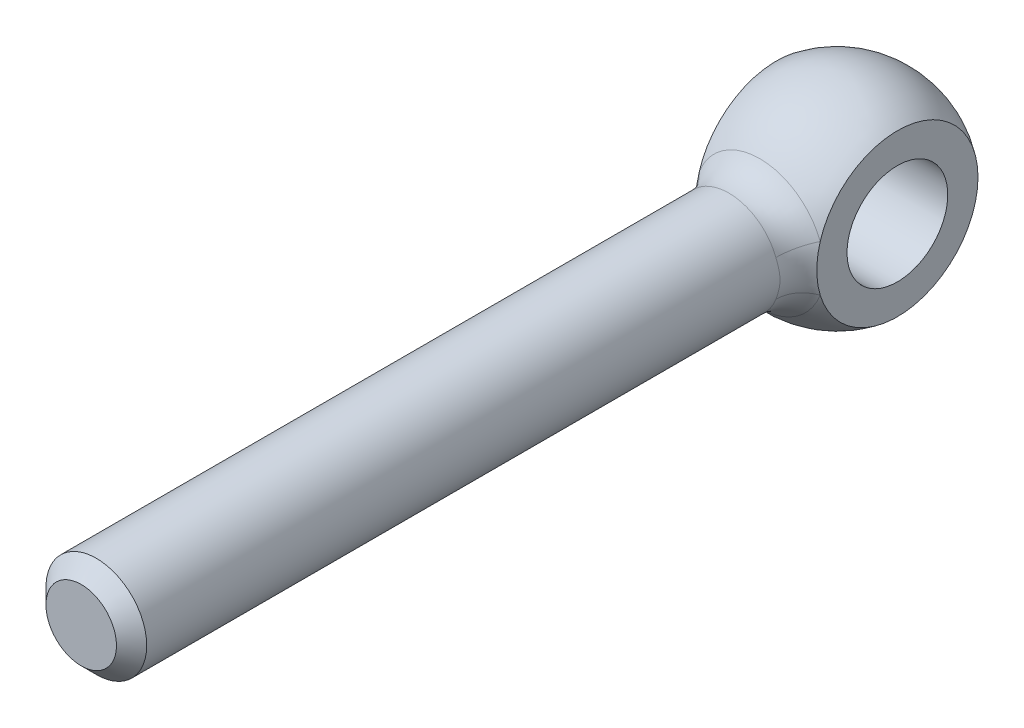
ISO-10303-21;
HEADER;
FILE_DESCRIPTION(('STEP AP214'),'2;1');
FILE_NAME('part.step','',(''),(''),'','','');
FILE_SCHEMA(('AUTOMOTIVE_DESIGN { 1 0 10303 214 1 1 1 1 }'));
ENDSEC;
DATA;
#1=APPLICATION_CONTEXT('core data for automotive mechanical design processes');
#2=APPLICATION_PROTOCOL_DEFINITION('international standard','automotive_design',2000,#1);
#3=PRODUCT_CONTEXT('',#1,'mechanical');
#4=PRODUCT('Part','Part','',(#3));
#5=PRODUCT_RELATED_PRODUCT_CATEGORY('part','',(#4));
#6=PRODUCT_DEFINITION_FORMATION('','',#4);
#7=PRODUCT_DEFINITION_CONTEXT('part definition',#1,'design');
#8=PRODUCT_DEFINITION('design','',#6,#7);
#9=PRODUCT_DEFINITION_SHAPE('','',#8);
#10=(LENGTH_UNIT() NAMED_UNIT(*) SI_UNIT(.MILLI.,.METRE.));
#11=(NAMED_UNIT(*) PLANE_ANGLE_UNIT() SI_UNIT($,.RADIAN.));
#12=(NAMED_UNIT(*) SI_UNIT($,.STERADIAN.) SOLID_ANGLE_UNIT());
#13=UNCERTAINTY_MEASURE_WITH_UNIT(LENGTH_MEASURE(1.E-05),#10,'distance_accuracy_value','');
#14=(GEOMETRIC_REPRESENTATION_CONTEXT(3) GLOBAL_UNCERTAINTY_ASSIGNED_CONTEXT((#13)) GLOBAL_UNIT_ASSIGNED_CONTEXT((#10,
#11,#12)) REPRESENTATION_CONTEXT('',''));
#15=CARTESIAN_POINT('',(0.,0.,0.));
#16=DIRECTION('',(0.,0.,1.));
#17=DIRECTION('',(1.,0.,0.));
#18=AXIS2_PLACEMENT_3D('',#15,#16,#17);
#19=CARTESIAN_POINT('',(0.,0.,0.));
#20=DIRECTION('',(-1.,0.,0.));
#21=DIRECTION('',(0.,0.,-1.));
#22=AXIS2_PLACEMENT_3D('',#19,#20,#21);
#23=SPHERICAL_SURFACE('',#22,10.);
#24=CARTESIAN_POINT('',(6.,0.,0.));
#25=DIRECTION('',(1.,0.,0.));
#26=DIRECTION('',(0.,0.,1.));
#27=AXIS2_PLACEMENT_3D('',#24,#25,#26);
#28=CIRCLE('',#27,8.);
#29=CARTESIAN_POINT('',(6.,2.30792777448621,7.65986092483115));
#30=VERTEX_POINT('',#29);
#31=CARTESIAN_POINT('',(6.,-2.30792777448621,7.65986092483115));
#32=VERTEX_POINT('',#31);
#33=EDGE_CURVE('E64',#30,#32,#28,.F.);
#34=ORIENTED_EDGE('',*,*,#33,.T.);
#35=CARTESIAN_POINT('',(0.,0.,7.65986092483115));
#36=DIRECTION('',(0.,0.,-1.));
#37=DIRECTION('',(-1.,0.,0.));
#38=AXIS2_PLACEMENT_3D('',#35,#36,#37);
#39=CIRCLE('',#38,6.42857142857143);
#40=CARTESIAN_POINT('',(-6.,-2.30792777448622,7.65986092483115));
#41=VERTEX_POINT('',#40);
#42=EDGE_CURVE('E72',#32,#41,#39,.T.);
#43=ORIENTED_EDGE('',*,*,#42,.T.);
#44=CARTESIAN_POINT('',(-6.,0.,0.));
#45=DIRECTION('',(1.,0.,0.));
#46=DIRECTION('',(0.,0.,1.));
#47=AXIS2_PLACEMENT_3D('',#44,#45,#46);
#48=CIRCLE('',#47,8.);
#49=CARTESIAN_POINT('',(-6.,2.30792777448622,7.65986092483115));
#50=VERTEX_POINT('',#49);
#51=EDGE_CURVE('E60',#50,#41,#48,.F.);
#52=ORIENTED_EDGE('',*,*,#51,.F.);
#53=CARTESIAN_POINT('',(0.,0.,7.65986092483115));
#54=DIRECTION('',(0.,0.,-1.));
#55=DIRECTION('',(-1.,0.,0.));
#56=AXIS2_PLACEMENT_3D('',#53,#54,#55);
#57=CIRCLE('',#56,6.42857142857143);
#58=EDGE_CURVE('E69',#50,#30,#57,.T.);
#59=ORIENTED_EDGE('',*,*,#58,.T.);
#60=EDGE_LOOP('',(#34,#43,#52,#59));
#61=FACE_BOUND('',#60,.T.);
#62=ADVANCED_FACE('F14',(#61),#23,.T.);
#63=CARTESIAN_POINT('',(0.,0.,-10.));
#64=DIRECTION('',(0.,0.,-1.));
#65=DIRECTION('',(1.,0.,0.));
#66=AXIS2_PLACEMENT_3D('',#63,#64,#65);
#67=CYLINDRICAL_SURFACE('',#66,5.);
#68=CARTESIAN_POINT('',(6.,3.2267323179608,7.3203960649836));
#69=CARTESIAN_POINT('',(4.3927793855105,2.40032191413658,8.4981017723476));
#70=CARTESIAN_POINT('',(4.26719928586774,2.60595668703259,10.6417078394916));
#71=CARTESIAN_POINT('',(6.,3.15637994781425,7.35140196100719));
#72=CARTESIAN_POINT('',(4.41396770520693,2.35868794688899,8.53415924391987));
#73=CARTESIAN_POINT('',(4.30636952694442,2.54182050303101,10.6569167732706));
#74=CARTESIAN_POINT('',(6.,3.0845678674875,7.38184900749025));
#75=CARTESIAN_POINT('',(4.43598568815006,2.31489371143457,8.5688842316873));
#76=CARTESIAN_POINT('',(4.34415743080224,2.47668749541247,10.6696741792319));
#77=CARTESIAN_POINT('',(6.,2.93788308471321,7.44144632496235));
#78=CARTESIAN_POINT('',(4.48100668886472,2.22296783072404,8.63529633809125));
#79=CARTESIAN_POINT('',(4.41682149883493,2.34464512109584,10.6908098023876));
#80=CARTESIAN_POINT('',(6.,2.86301195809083,7.4705972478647));
#81=CARTESIAN_POINT('',(4.50400416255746,2.1748602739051,8.6669999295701));
#82=CARTESIAN_POINT('',(4.45169913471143,2.27773667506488,10.699190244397));
#83=CARTESIAN_POINT('',(6.,2.63359256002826,7.55584558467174));
#84=CARTESIAN_POINT('',(4.5734661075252,2.02411950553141,8.75712422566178));
#85=CARTESIAN_POINT('',(4.55175884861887,2.07466593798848,10.7185614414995));
#86=CARTESIAN_POINT('',(6.,2.47414356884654,7.60978095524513));
#87=CARTESIAN_POINT('',(4.62076994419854,1.91438028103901,8.8111571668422));
#88=CARTESIAN_POINT('',(4.61242106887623,1.9360709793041,10.7238012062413));
#89=CARTESIAN_POINT('',(6.,2.15560728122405,7.70575431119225));
#90=CARTESIAN_POINT('',(4.70836207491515,1.68665244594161,8.90207343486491));
#91=CARTESIAN_POINT('',(4.71637744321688,1.66582754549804,10.7238090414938));
#92=CARTESIAN_POINT('',(6.,1.99760407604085,7.74840995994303));
#93=CARTESIAN_POINT('',(4.7489352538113,1.57023745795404,8.94011459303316));
#94=CARTESIAN_POINT('',(4.76069958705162,1.53456694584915,10.7194159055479));
#95=CARTESIAN_POINT('',(6.,1.67034421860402,7.82548342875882));
#96=CARTESIAN_POINT('',(4.82366839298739,1.32353889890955,9.00539080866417));
#97=CARTESIAN_POINT('',(4.83830988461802,1.26882691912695,10.7060668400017));
#98=CARTESIAN_POINT('',(6.,1.50108215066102,7.85989724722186));
#99=CARTESIAN_POINT('',(4.85792118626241,1.19318069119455,9.03274138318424));
#100=CARTESIAN_POINT('',(4.87159268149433,1.13434596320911,10.6971087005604));
#101=CARTESIAN_POINT('',(6.,1.15262565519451,7.91850047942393));
#102=CARTESIAN_POINT('',(4.91671483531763,0.921194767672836,9.07731285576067));
#103=CARTESIAN_POINT('',(4.92691418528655,0.862968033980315,10.6789999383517));
#104=CARTESIAN_POINT('',(6.,0.97342214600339,7.94268036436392));
#105=CARTESIAN_POINT('',(4.94135412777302,0.779366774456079,9.09462093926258));
#106=CARTESIAN_POINT('',(4.94894241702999,0.726068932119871,10.6698491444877));
#107=CARTESIAN_POINT('',(6.,0.608286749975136,7.97894634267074));
#108=CARTESIAN_POINT('',(4.97835060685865,0.488614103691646,9.11990305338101));
#109=CARTESIAN_POINT('',(4.98155564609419,0.450879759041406,10.6552429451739));
#110=CARTESIAN_POINT('',(6.,0.42235660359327,7.9910355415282));
#111=CARTESIAN_POINT('',(4.99079415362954,0.339389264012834,9.12793953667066));
#112=CARTESIAN_POINT('',(4.99214358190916,0.312590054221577,10.6497865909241));
#113=CARTESIAN_POINT('',(6.,0.0470401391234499,8.0020775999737));
#114=CARTESIAN_POINT('',(5.00212876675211,0.037959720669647,9.13527953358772));
#115=CARTESIAN_POINT('',(5.0018265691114,0.0346295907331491,10.6448278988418));
#116=CARTESIAN_POINT('',(6.,-0.142361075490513,8.0009406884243));
#117=CARTESIAN_POINT('',(5.00095572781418,-0.114635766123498,9.13454178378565));
#118=CARTESIAN_POINT('',(5.00084307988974,-0.105044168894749,10.6453662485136));
#119=CARTESIAN_POINT('',(6.,-0.51810128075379,7.98542192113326));
#120=CARTESIAN_POINT('',(4.98503390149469,-0.416175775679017,9.12417872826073));
#121=CARTESIAN_POINT('',(4.98720206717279,-0.383785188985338,10.652268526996));
#122=CARTESIAN_POINT('',(6.,-0.704439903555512,7.97103848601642));
#123=CARTESIAN_POINT('',(4.9702437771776,-0.565490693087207,9.11452643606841));
#124=CARTESIAN_POINT('',(4.97454315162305,-0.522852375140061,10.6586331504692));
#125=CARTESIAN_POINT('',(6.,-1.06953275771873,7.93031431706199));
#126=CARTESIAN_POINT('',(4.92878330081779,-0.855453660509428,9.08576459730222));
#127=CARTESIAN_POINT('',(4.93766171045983,-0.799340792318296,10.6744961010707));
#128=CARTESIAN_POINT('',(6.,-1.24828908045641,7.9039769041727));
#129=CARTESIAN_POINT('',(4.90202436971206,-0.996394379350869,9.06658927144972));
#130=CARTESIAN_POINT('',(4.91344239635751,-0.936762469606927,10.6839935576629));
#131=CARTESIAN_POINT('',(6.,-1.59553264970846,7.84126612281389));
#132=CARTESIAN_POINT('',(4.83940307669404,-1.26604567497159,9.01799514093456));
#133=CARTESIAN_POINT('',(4.85359923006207,-1.20914010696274,10.7020036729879));
#134=CARTESIAN_POINT('',(6.,-1.76401866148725,7.80489155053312));
#135=CARTESIAN_POINT('',(4.80342965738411,-1.39492473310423,8.98847100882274));
#136=CARTESIAN_POINT('',(4.81797400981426,-1.34409576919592,10.7105162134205));
#137=CARTESIAN_POINT('',(6.,-2.08964080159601,7.72409131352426));
#138=CARTESIAN_POINT('',(4.72580117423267,-1.63827852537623,8.91856014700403));
#139=CARTESIAN_POINT('',(4.7355062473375,-1.61073332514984,10.7220684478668));
#140=CARTESIAN_POINT('',(6.,-2.24676902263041,7.67966011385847));
#141=CARTESIAN_POINT('',(4.68404997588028,-1.75278971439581,8.87803959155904));
#142=CARTESIAN_POINT('',(4.68865598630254,-1.74241289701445,10.7251043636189));
#143=CARTESIAN_POINT('',(6.,-2.54938213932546,7.5845769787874));
#144=CARTESIAN_POINT('',(4.59869902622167,-1.96626185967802,8.78604728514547));
#145=CARTESIAN_POINT('',(4.58413287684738,-2.001300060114,10.7214381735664));
#146=CARTESIAN_POINT('',(6.,-2.69487333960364,7.53392844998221));
#147=CARTESIAN_POINT('',(4.55505237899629,-2.06517695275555,8.73445253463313));
#148=CARTESIAN_POINT('',(4.52646594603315,-2.1285100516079,10.7147413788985));
#149=CARTESIAN_POINT('',(6.,-2.97563340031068,7.42753384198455));
#150=CARTESIAN_POINT('',(4.46945882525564,-2.24823791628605,8.62043143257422));
#151=CARTESIAN_POINT('',(4.40053898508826,-2.37799449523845,10.6877579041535));
#152=CARTESIAN_POINT('',(6.,-3.11084689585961,7.37176329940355));
#153=CARTESIAN_POINT('',(4.42753255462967,-2.33217907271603,8.55784369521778));
#154=CARTESIAN_POINT('',(4.3322269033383,-2.50024076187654,10.6674027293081));
#155=CARTESIAN_POINT('',(6.,-3.30618612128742,7.28520546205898));
#156=CARTESIAN_POINT('',(4.36877466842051,-2.44740194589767,8.4568984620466));
#157=CARTESIAN_POINT('',(4.22266455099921,-2.6784309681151,10.6241540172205));
#158=CARTESIAN_POINT('',(6.,-3.37012775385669,7.25583055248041));
#159=CARTESIAN_POINT('',(4.34979966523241,-2.48417205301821,8.42189416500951));
#160=CARTESIAN_POINT('',(4.18490963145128,-2.73703466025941,10.6075896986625));
#161=CARTESIAN_POINT('',(6.,-3.49564302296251,7.19620015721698));
#162=CARTESIAN_POINT('',(4.31353045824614,-2.55449740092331,8.34959125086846));
#163=CARTESIAN_POINT('',(4.10720301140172,-2.85231842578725,10.5698584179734));
#164=CARTESIAN_POINT('',(6.,-3.55721601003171,7.16594443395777));
#165=CARTESIAN_POINT('',(4.29624676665,-2.58803247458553,8.31228600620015));
#166=CARTESIAN_POINT('',(4.06725071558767,-2.90899797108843,10.5486902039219));
#167=CARTESIAN_POINT('',(6.,-3.61768386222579,7.13529000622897));
#168=CARTESIAN_POINT('',(4.28001098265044,-2.62004266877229,8.27400289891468));
#169=CARTESIAN_POINT('',(4.02628463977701,-2.96463016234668,10.5250470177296));
#170=(BOUNDED_SURFACE() B_SPLINE_SURFACE(3,2,((#68,#69,#70),(#71,#72,#73),(#74,#75,#76),(#77,
#78,#79),(#80,#81,#82),(#83,#84,#85),(#86,#87,#88),(#89,#90,#91),(#92,#93,#94),(#95,#96,#97),
(#98,#99,#100),(#101,#102,#103),(#104,#105,#106),(#107,#108,#109),(#110,#111,#112),(#113,#114,
#115),(#116,#117,#118),(#119,#120,#121),(#122,#123,#124),(#125,#126,#127),(#128,#129,#130),
(#131,#132,#133),(#134,#135,#136),(#137,#138,#139),(#140,#141,#142),(#143,#144,#145),(#146,#147,
#148),(#149,#150,#151),(#152,#153,#154),(#155,#156,#157),(#158,#159,#160),(#161,#162,#163),
(#164,#165,#166),(#167,#168,#169)),.UNSPECIFIED.,.F.,.F.,.F.) B_SPLINE_SURFACE_WITH_KNOTS((4,2,
2,2,2,2,2,2,2,2,2,2,2,2,2,2,4),(3,3),(0.,0.408247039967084,0.816286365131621,1.63181270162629,
2.37916270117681,3.12687482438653,3.87528161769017,4.62349613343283,5.37679204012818,
6.13017777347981,6.88335433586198,7.63662127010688,8.39040767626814,9.14378289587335,
9.90096470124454,10.2805077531,10.6601541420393),(0.,1.),
.UNSPECIFIED.) GEOMETRIC_REPRESENTATION_ITEM() RATIONAL_B_SPLINE_SURFACE(((1.,0.880171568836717,
1.),(1.,0.8823764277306,1.),(1.,0.884598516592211,1.),(1.,0.889041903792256,1.),(1.,
0.891263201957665,1.),(1.,0.897873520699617,1.),(1.,0.902212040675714,1.),(1.,0.910097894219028,
1.),(1.,0.913681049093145,1.),(1.,0.920229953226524,1.),(1.,0.923195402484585,1.),(1.,
0.928274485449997,1.),(1.,0.93038732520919,1.),(1.,0.933563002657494,1.),(1.,0.934626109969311,
1.),(1.,0.935596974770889,1.),(1.,0.935496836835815,1.),(1.,0.934132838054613,1.),(1.,
0.932868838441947,1.),(1.,0.929307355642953,1.),(1.,0.927010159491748,1.),(1.,0.921590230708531,
1.),(1.,0.918467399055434,1.),(1.,0.911637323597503,1.),(1.,0.907929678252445,1.),(1.,
0.90018481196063,1.),(1.,0.89614777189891,1.),(1.,0.88796108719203,1.),(1.,0.883810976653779,
1.),(1.,0.877676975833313,1.),(1.,0.875645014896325,1.),(1.,0.871634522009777,1.),(1.,
0.8696560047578,1.),(1.,0.867715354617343,1.))) REPRESENTATION_ITEM('') SURFACE());
#171=CARTESIAN_POINT('',(4.02628463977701,-2.96463016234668,10.5250470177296));
#172=CARTESIAN_POINT('',(4.06725071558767,-2.90899797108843,10.5486902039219));
#173=CARTESIAN_POINT('',(4.10720301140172,-2.85231842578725,10.5698584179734));
#174=CARTESIAN_POINT('',(4.18490963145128,-2.73703466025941,10.6075896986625));
#175=CARTESIAN_POINT('',(4.22266455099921,-2.6784309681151,10.6241540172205));
#176=CARTESIAN_POINT('',(4.3322269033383,-2.50024076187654,10.6674027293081));
#177=CARTESIAN_POINT('',(4.40053898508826,-2.37799449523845,10.6877579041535));
#178=CARTESIAN_POINT('',(4.52646594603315,-2.1285100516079,10.7147413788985));
#179=CARTESIAN_POINT('',(4.58413287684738,-2.001300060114,10.7214381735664));
#180=CARTESIAN_POINT('',(4.68865598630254,-1.74241289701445,10.7251043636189));
#181=CARTESIAN_POINT('',(4.7355062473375,-1.61073332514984,10.7220684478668));
#182=CARTESIAN_POINT('',(4.81797400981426,-1.34409576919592,10.7105162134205));
#183=CARTESIAN_POINT('',(4.85359923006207,-1.20914010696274,10.7020036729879));
#184=CARTESIAN_POINT('',(4.91344239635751,-0.936762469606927,10.6839935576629));
#185=CARTESIAN_POINT('',(4.93766171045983,-0.799340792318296,10.6744961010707));
#186=CARTESIAN_POINT('',(4.97454315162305,-0.522852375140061,10.6586331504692));
#187=CARTESIAN_POINT('',(4.98720206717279,-0.383785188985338,10.652268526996));
#188=CARTESIAN_POINT('',(5.00084307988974,-0.105044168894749,10.6453662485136));
#189=CARTESIAN_POINT('',(5.0018265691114,0.0346295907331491,10.6448278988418));
#190=CARTESIAN_POINT('',(4.99214358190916,0.312590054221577,10.6497865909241));
#191=CARTESIAN_POINT('',(4.98155564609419,0.450879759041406,10.6552429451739));
#192=CARTESIAN_POINT('',(4.94894241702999,0.726068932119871,10.6698491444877));
#193=CARTESIAN_POINT('',(4.92691418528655,0.862968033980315,10.6789999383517));
#194=CARTESIAN_POINT('',(4.87159268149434,1.13434596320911,10.6971087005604));
#195=CARTESIAN_POINT('',(4.83830988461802,1.26882691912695,10.7060668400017));
#196=CARTESIAN_POINT('',(4.76069958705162,1.53456694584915,10.7194159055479));
#197=CARTESIAN_POINT('',(4.71637744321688,1.66582754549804,10.7238090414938));
#198=CARTESIAN_POINT('',(4.61242106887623,1.9360709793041,10.7238012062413));
#199=CARTESIAN_POINT('',(4.55175884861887,2.07466593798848,10.7185614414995));
#200=CARTESIAN_POINT('',(4.45169913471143,2.27773667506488,10.699190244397));
#201=CARTESIAN_POINT('',(4.41682149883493,2.34464512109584,10.6908098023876));
#202=CARTESIAN_POINT('',(4.34415743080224,2.47668749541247,10.6696741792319));
#203=CARTESIAN_POINT('',(4.30636952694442,2.54182050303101,10.6569167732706));
#204=CARTESIAN_POINT('',(4.26719928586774,2.60595668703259,10.6417078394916));
#205=B_SPLINE_CURVE_WITH_KNOTS('',3,(#171,#172,#173,#174,#175,#176,#177,#178,#179,#180,#181,
#182,#183,#184,#185,#186,#187,#188,#189,#190,#191,#192,#193,#194,#195,#196,#197,#198,#199,#200,
#201,#202,#203,#204),.UNSPECIFIED.,.F.,.F.,(4,2,2,2,2,2,2,2,2,2,2,2,2,2,2,2,4),(0.,
0.379646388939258,0.759189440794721,1.51637124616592,2.26974646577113,3.02353287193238,
3.77679980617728,4.52997636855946,5.28336210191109,6.03665800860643,6.7848725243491,
7.53327931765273,8.28099144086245,9.02834144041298,9.84386777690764,10.2519071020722,
10.6601541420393),.UNSPECIFIED.);
#206=CARTESIAN_POINT('',(4.66666666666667,-1.7950549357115,10.7238052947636));
#207=VERTEX_POINT('',#206);
#208=CARTESIAN_POINT('',(4.66666666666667,1.7950549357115,10.7238052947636));
#209=VERTEX_POINT('',#208);
#210=EDGE_CURVE('E87',#207,#209,#205,.T.);
#211=ORIENTED_EDGE('',*,*,#210,.T.);
#212=CARTESIAN_POINT('',(0.,0.,10.7238052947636));
#213=DIRECTION('',(0.,0.,-1.));
#214=DIRECTION('',(-1.,0.,0.));
#215=AXIS2_PLACEMENT_3D('',#212,#213,#214);
#216=CIRCLE('',#215,5.);
#217=CARTESIAN_POINT('',(-4.66666666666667,1.79505493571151,10.7238052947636));
#218=VERTEX_POINT('',#217);
#219=EDGE_CURVE('E9',#209,#218,#216,.F.);
#220=ORIENTED_EDGE('',*,*,#219,.T.);
#221=CARTESIAN_POINT('',(-6.,-3.2267323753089,7.32039603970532));
#222=CARTESIAN_POINT('',(-4.39277936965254,-2.40032194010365,8.49810174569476));
#223=CARTESIAN_POINT('',(-4.26719928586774,-2.60595668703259,10.6417078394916));
#224=CARTESIAN_POINT('',(-6.,-3.15637996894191,7.35140195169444));
#225=CARTESIAN_POINT('',(-4.41396769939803,-2.35868795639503,8.53415923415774));
#226=CARTESIAN_POINT('',(-4.30636952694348,-2.54182050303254,10.6569167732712));
#227=CARTESIAN_POINT('',(-6.,-3.08456787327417,7.38184900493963));
#228=CARTESIAN_POINT('',(-4.43598568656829,-2.31489371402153,8.5688842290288));
#229=CARTESIAN_POINT('',(-4.34415743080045,-2.47668749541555,10.6696741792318));
#230=CARTESIAN_POINT('',(-6.,-2.93788307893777,7.4414463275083));
#231=CARTESIAN_POINT('',(-4.48100669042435,-2.22296782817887,8.63529634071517));
#232=CARTESIAN_POINT('',(-4.41682149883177,-2.34464512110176,10.6908098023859));
#233=CARTESIAN_POINT('',(-6.,-2.86301195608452,7.47059724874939));
#234=CARTESIAN_POINT('',(-4.50400416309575,-2.17486027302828,8.66699993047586));
#235=CARTESIAN_POINT('',(-4.45169913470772,-2.27773667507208,10.6991902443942));
#236=CARTESIAN_POINT('',(-6.,-2.63359256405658,7.55584558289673));
#237=CARTESIAN_POINT('',(-4.57346610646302,-2.02411950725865,8.75712422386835));
#238=CARTESIAN_POINT('',(-4.55175884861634,-2.07466593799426,10.7185614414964));
#239=CARTESIAN_POINT('',(-6.,-2.47414356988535,7.60978095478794));
#240=CARTESIAN_POINT('',(-4.62076994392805,-1.91438028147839,8.81115716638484));
#241=CARTESIAN_POINT('',(-4.6124210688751,-1.93607097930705,10.7238012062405));
#242=CARTESIAN_POINT('',(-6.,-2.15560728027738,7.70575431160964));
#243=CARTESIAN_POINT('',(-4.70836207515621,-1.68665244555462,8.9020734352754));
#244=CARTESIAN_POINT('',(-4.71637744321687,-1.66582754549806,10.7238090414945));
#245=CARTESIAN_POINT('',(-6.,-1.99760407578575,7.74840996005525));
#246=CARTESIAN_POINT('',(-4.74893525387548,-1.57023745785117,8.94011459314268));
#247=CARTESIAN_POINT('',(-4.76069958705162,-1.53456694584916,10.7194159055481));
#248=CARTESIAN_POINT('',(-6.,-1.67034421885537,7.82548342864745));
#249=CARTESIAN_POINT('',(-4.82366839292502,-1.3235388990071,9.00539080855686));
#250=CARTESIAN_POINT('',(-4.83830988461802,-1.26882691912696,10.7060668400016));
#251=CARTESIAN_POINT('',(-6.,-1.50108215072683,7.85989724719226));
#252=CARTESIAN_POINT('',(-4.85792118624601,-1.19318069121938,9.03274138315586));
#253=CARTESIAN_POINT('',(-4.87159268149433,-1.13434596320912,10.6971087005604));
#254=CARTESIAN_POINT('',(-6.,-1.15262565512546,7.91850047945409));
#255=CARTESIAN_POINT('',(-4.91671483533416,-0.921194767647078,9.07731285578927));
#256=CARTESIAN_POINT('',(-4.92691418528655,-0.862968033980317,10.6789999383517));
#257=CARTESIAN_POINT('',(-6.,-0.973422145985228,7.942680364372));
#258=CARTESIAN_POINT('',(-4.94135412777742,-0.779366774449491,9.09462093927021));
#259=CARTESIAN_POINT('',(-4.94894241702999,-0.726068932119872,10.6698491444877));
#260=CARTESIAN_POINT('',(-6.,-0.608286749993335,7.97894634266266));
#261=CARTESIAN_POINT('',(-4.97835060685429,-0.488614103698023,9.11990305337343));
#262=CARTESIAN_POINT('',(-4.98155564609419,-0.450879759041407,10.6552429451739));
#263=CARTESIAN_POINT('',(-6.,-0.422356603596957,7.99103554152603));
#264=CARTESIAN_POINT('',(-4.99079415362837,-0.339389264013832,9.12793953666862));
#265=CARTESIAN_POINT('',(-4.99214358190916,-0.312590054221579,10.6497865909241));
#266=CARTESIAN_POINT('',(-6.,-0.047040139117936,8.00207759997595));
#267=CARTESIAN_POINT('',(-5.00212876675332,-0.0379597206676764,9.13527953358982));
#268=CARTESIAN_POINT('',(-5.0018265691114,-0.0346295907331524,10.6448278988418));
#269=CARTESIAN_POINT('',(-6.,0.142361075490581,8.00094068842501));
#270=CARTESIAN_POINT('',(-5.00095572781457,0.11463576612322,9.1345417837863));
#271=CARTESIAN_POINT('',(-5.00084307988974,0.105044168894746,10.6453662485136));
#272=CARTESIAN_POINT('',(-6.,0.518101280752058,7.98542192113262));
#273=CARTESIAN_POINT('',(-4.98503390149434,0.41617577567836,9.12417872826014));
#274=CARTESIAN_POINT('',(-4.9872020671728,0.383785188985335,10.652268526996));
#275=CARTESIAN_POINT('',(-6.,0.704439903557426,7.97103848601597));
#276=CARTESIAN_POINT('',(-4.97024377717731,0.565490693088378,9.11452643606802));
#277=CARTESIAN_POINT('',(-4.97454315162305,0.522852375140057,10.6586331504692));
#278=CARTESIAN_POINT('',(-6.,1.06953275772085,7.93031431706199));
#279=CARTESIAN_POINT('',(-4.92878330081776,0.85545366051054,9.08576459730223));
#280=CARTESIAN_POINT('',(-4.93766171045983,0.799340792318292,10.6744961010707));
#281=CARTESIAN_POINT('',(-6.,1.2482890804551,7.90397690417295));
#282=CARTESIAN_POINT('',(-4.90202436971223,0.996394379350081,9.06658927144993));
#283=CARTESIAN_POINT('',(-4.91344239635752,0.936762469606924,10.6839935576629));
#284=CARTESIAN_POINT('',(-6.,1.59553264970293,7.84126612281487));
#285=CARTESIAN_POINT('',(-4.83940307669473,1.26604567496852,9.01799514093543));
#286=CARTESIAN_POINT('',(-4.85359923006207,1.20914010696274,10.7020036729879));
#287=CARTESIAN_POINT('',(-6.,1.76401866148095,7.80489155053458));
#288=CARTESIAN_POINT('',(-4.80342965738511,1.39492473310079,8.98847100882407));
#289=CARTESIAN_POINT('',(-4.81797400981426,1.34409576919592,10.7105162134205));
#290=CARTESIAN_POINT('',(-6.,2.08964080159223,7.72409131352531));
#291=CARTESIAN_POINT('',(-4.72580117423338,1.63827852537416,8.918560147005));
#292=CARTESIAN_POINT('',(-4.7355062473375,1.61073332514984,10.7220684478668));
#293=CARTESIAN_POINT('',(-6.,2.24676902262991,7.67966011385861));
#294=CARTESIAN_POINT('',(-4.68404997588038,1.75278971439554,8.87803959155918));
#295=CARTESIAN_POINT('',(-4.68865598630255,1.74241289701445,10.7251043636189));
#296=CARTESIAN_POINT('',(-6.,2.54938213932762,7.58457697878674));
#297=CARTESIAN_POINT('',(-4.59869902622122,1.96626185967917,8.78604728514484));
#298=CARTESIAN_POINT('',(-4.58413287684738,2.00130006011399,10.7214381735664));
#299=CARTESIAN_POINT('',(-6.,2.69487333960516,7.53392844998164));
#300=CARTESIAN_POINT('',(-4.55505237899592,2.06517695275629,8.73445253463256));
#301=CARTESIAN_POINT('',(-4.52646594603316,2.12851005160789,10.7147413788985));
#302=CARTESIAN_POINT('',(-6.,2.97563340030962,7.42753384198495));
#303=CARTESIAN_POINT('',(-4.4694588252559,2.24823791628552,8.62043143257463));
#304=CARTESIAN_POINT('',(-4.40053898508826,2.37799449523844,10.6877579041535));
#305=CARTESIAN_POINT('',(-6.,3.11084689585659,7.37176329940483));
#306=CARTESIAN_POINT('',(-4.42753255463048,2.33217907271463,8.55784369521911));
#307=CARTESIAN_POINT('',(-4.33222690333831,2.50024076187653,10.6674027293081));
#308=CARTESIAN_POINT('',(-6.,3.30618612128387,7.28520546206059));
#309=CARTESIAN_POINT('',(-4.3687746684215,2.44740194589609,8.45689846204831));
#310=CARTESIAN_POINT('',(-4.22266455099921,2.67843096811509,10.6241540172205));
#311=CARTESIAN_POINT('',(-6.,3.37012775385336,7.25583055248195));
#312=CARTESIAN_POINT('',(-4.34979966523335,2.48417205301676,8.42189416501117));
#313=CARTESIAN_POINT('',(-4.18490963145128,2.73703466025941,10.6075896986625));
#314=CARTESIAN_POINT('',(-6.,3.4956430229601,7.19620015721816));
#315=CARTESIAN_POINT('',(-4.31353045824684,2.55449740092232,8.34959125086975));
#316=CARTESIAN_POINT('',(-4.10720301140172,2.85231842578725,10.5698584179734));
#317=CARTESIAN_POINT('',(-6.,3.55721601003,7.16594443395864));
#318=CARTESIAN_POINT('',(-4.2962467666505,2.58803247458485,8.3122860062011));
#319=CARTESIAN_POINT('',(-4.06725071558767,2.90899797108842,10.5486902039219));
#320=CARTESIAN_POINT('',(-6.,3.61768386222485,7.13529000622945));
#321=CARTESIAN_POINT('',(-4.28001098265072,2.62004266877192,8.27400289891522));
#322=CARTESIAN_POINT('',(-4.02628463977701,2.96463016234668,10.5250470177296));
#323=(BOUNDED_SURFACE() B_SPLINE_SURFACE(3,2,((#221,#222,#223),(#224,#225,#226),(#227,#228,
#229),(#230,#231,#232),(#233,#234,#235),(#236,#237,#238),(#239,#240,#241),(#242,#243,#244),
(#245,#246,#247),(#248,#249,#250),(#251,#252,#253),(#254,#255,#256),(#257,#258,#259),(#260,#261,
#262),(#263,#264,#265),(#266,#267,#268),(#269,#270,#271),(#272,#273,#274),(#275,#276,#277),
(#278,#279,#280),(#281,#282,#283),(#284,#285,#286),(#287,#288,#289),(#290,#291,#292),(#293,#294,
#295),(#296,#297,#298),(#299,#300,#301),(#302,#303,#304),(#305,#306,#307),(#308,#309,#310),
(#311,#312,#313),(#314,#315,#316),(#317,#318,#319),(#320,#321,#322)),.UNSPECIFIED.,.F.,.F.,
.F.) B_SPLINE_SURFACE_WITH_KNOTS((4,2,2,2,2,2,2,2,2,2,2,2,2,2,2,2,4),(3,3),(0.,
0.408247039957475,0.816286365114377,1.63181270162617,2.37916270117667,3.12687482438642,
3.87528161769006,4.62349613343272,5.37679204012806,6.13017777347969,6.88335433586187,
7.63662127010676,8.39040767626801,9.14378289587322,9.90096470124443,10.2805077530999,
10.6601541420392),(0.,1.),
.UNSPECIFIED.) GEOMETRIC_REPRESENTATION_ITEM() RATIONAL_B_SPLINE_SURFACE(((1.,0.880171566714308,
1.),(1.,0.882376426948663,1.),(1.,0.884598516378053,1.),(1.,0.88904190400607,1.),(1.,
0.89126320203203,1.),(1.,0.897873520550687,1.),(1.,0.902212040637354,1.),(1.,0.910097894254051,
1.),(1.,0.913681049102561,1.),(1.,0.920229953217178,1.),(1.,0.9231954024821,1.),(1.,
0.928274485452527,1.),(1.,0.930387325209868,1.),(1.,0.933563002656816,1.),(1.,0.934626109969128,
1.),(1.,0.935596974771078,1.),(1.,0.935496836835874,1.),(1.,0.93413283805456,1.),(1.,
0.93286883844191,1.),(1.,0.929307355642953,1.),(1.,0.927010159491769,1.),(1.,0.921590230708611,
1.),(1.,0.918467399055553,1.),(1.,0.911637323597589,1.),(1.,0.907929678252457,1.),(1.,
0.900184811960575,1.),(1.,0.896147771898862,1.),(1.,0.887961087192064,1.),(1.,0.883810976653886,
1.),(1.,0.877676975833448,1.),(1.,0.875645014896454,1.),(1.,0.871634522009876,1.),(1.,
0.869656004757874,1.),(1.,0.867715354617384,1.))) REPRESENTATION_ITEM('') SURFACE());
#324=CARTESIAN_POINT('',(-4.02628463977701,2.96463016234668,10.5250470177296));
#325=CARTESIAN_POINT('',(-4.06725071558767,2.90899797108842,10.5486902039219));
#326=CARTESIAN_POINT('',(-4.10720301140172,2.85231842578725,10.5698584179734));
#327=CARTESIAN_POINT('',(-4.18490963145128,2.73703466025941,10.6075896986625));
#328=CARTESIAN_POINT('',(-4.22266455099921,2.67843096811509,10.6241540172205));
#329=CARTESIAN_POINT('',(-4.33222690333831,2.50024076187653,10.6674027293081));
#330=CARTESIAN_POINT('',(-4.40053898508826,2.37799449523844,10.6877579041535));
#331=CARTESIAN_POINT('',(-4.52646594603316,2.12851005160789,10.7147413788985));
#332=CARTESIAN_POINT('',(-4.58413287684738,2.00130006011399,10.7214381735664));
#333=CARTESIAN_POINT('',(-4.68865598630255,1.74241289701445,10.7251043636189));
#334=CARTESIAN_POINT('',(-4.7355062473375,1.61073332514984,10.7220684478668));
#335=CARTESIAN_POINT('',(-4.81797400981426,1.34409576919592,10.7105162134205));
#336=CARTESIAN_POINT('',(-4.85359923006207,1.20914010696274,10.7020036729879));
#337=CARTESIAN_POINT('',(-4.91344239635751,0.936762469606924,10.6839935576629));
#338=CARTESIAN_POINT('',(-4.93766171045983,0.799340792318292,10.6744961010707));
#339=CARTESIAN_POINT('',(-4.97454315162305,0.522852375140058,10.6586331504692));
#340=CARTESIAN_POINT('',(-4.9872020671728,0.383785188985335,10.652268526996));
#341=CARTESIAN_POINT('',(-5.00084307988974,0.105044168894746,10.6453662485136));
#342=CARTESIAN_POINT('',(-5.0018265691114,-0.0346295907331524,10.6448278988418));
#343=CARTESIAN_POINT('',(-4.99214358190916,-0.312590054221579,10.6497865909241));
#344=CARTESIAN_POINT('',(-4.98155564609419,-0.450879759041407,10.6552429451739));
#345=CARTESIAN_POINT('',(-4.94894241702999,-0.726068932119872,10.6698491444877));
#346=CARTESIAN_POINT('',(-4.92691418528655,-0.862968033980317,10.6789999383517));
#347=CARTESIAN_POINT('',(-4.87159268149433,-1.13434596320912,10.6971087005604));
#348=CARTESIAN_POINT('',(-4.83830988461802,-1.26882691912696,10.7060668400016));
#349=CARTESIAN_POINT('',(-4.76069958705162,-1.53456694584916,10.7194159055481));
#350=CARTESIAN_POINT('',(-4.71637744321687,-1.66582754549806,10.7238090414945));
#351=CARTESIAN_POINT('',(-4.6124210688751,-1.93607097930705,10.7238012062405));
#352=CARTESIAN_POINT('',(-4.55175884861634,-2.07466593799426,10.7185614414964));
#353=CARTESIAN_POINT('',(-4.45169913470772,-2.27773667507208,10.6991902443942));
#354=CARTESIAN_POINT('',(-4.41682149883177,-2.34464512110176,10.6908098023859));
#355=CARTESIAN_POINT('',(-4.34415743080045,-2.47668749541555,10.6696741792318));
#356=CARTESIAN_POINT('',(-4.30636952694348,-2.54182050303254,10.6569167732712));
#357=CARTESIAN_POINT('',(-4.26719928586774,-2.60595668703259,10.6417078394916));
#358=B_SPLINE_CURVE_WITH_KNOTS('',3,(#324,#325,#326,#327,#328,#329,#330,#331,#332,#333,#334,
#335,#336,#337,#338,#339,#340,#341,#342,#343,#344,#345,#346,#347,#348,#349,#350,#351,#352,#353,
#354,#355,#356,#357),.UNSPECIFIED.,.F.,.F.,(4,2,2,2,2,2,2,2,2,2,2,2,2,2,2,2,4),(0.,
0.379646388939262,0.759189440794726,1.51637124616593,2.26974646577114,3.02353287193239,
3.77679980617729,4.52997636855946,5.28336210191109,6.03665800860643,6.78487252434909,
7.53327931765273,8.28099144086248,9.02834144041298,9.84386777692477,10.2519071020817,
10.6601541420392),.UNSPECIFIED.);
#359=CARTESIAN_POINT('',(-4.66666666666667,-1.79505493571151,10.7238052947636));
#360=VERTEX_POINT('',#359);
#361=EDGE_CURVE('E27',#218,#360,#358,.T.);
#362=ORIENTED_EDGE('',*,*,#361,.T.);
#363=CARTESIAN_POINT('',(0.,0.,10.7238052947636));
#364=DIRECTION('',(0.,0.,-1.));
#365=DIRECTION('',(-1.,0.,0.));
#366=AXIS2_PLACEMENT_3D('',#363,#364,#365);
#367=CIRCLE('',#366,5.);
#368=EDGE_CURVE('E101',#360,#207,#367,.F.);
#369=ORIENTED_EDGE('',*,*,#368,.T.);
#370=EDGE_LOOP('',(#211,#220,#362,#369));
#371=FACE_BOUND('',#370,.T.);
#372=CARTESIAN_POINT('',(0.,0.,73.5));
#373=DIRECTION('',(0.,0.,-1.));
#374=DIRECTION('',(1.,0.,0.));
#375=AXIS2_PLACEMENT_3D('',#372,#373,#374);
#376=CIRCLE('',#375,5.);
#377=CARTESIAN_POINT('',(5.,0.,73.5));
#378=VERTEX_POINT('',#377);
#379=EDGE_CURVE('E85',#378,#378,#376,.T.);
#380=ORIENTED_EDGE('',*,*,#379,.T.);
#381=EDGE_LOOP('',(#380));
#382=FACE_BOUND('',#381,.T.);
#383=ADVANCED_FACE('F107',(#371,#382),#67,.T.);
#384=CARTESIAN_POINT('',(0.,0.,75.));
#385=DIRECTION('',(0.,0.,-1.));
#386=DIRECTION('',(1.,0.,0.));
#387=AXIS2_PLACEMENT_3D('',#384,#385,#386);
#388=CONICAL_SURFACE('',#387,3.5,0.785398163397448);
#389=ORIENTED_EDGE('',*,*,#379,.F.);
#390=EDGE_LOOP('',(#389));
#391=FACE_BOUND('',#390,.T.);
#392=CARTESIAN_POINT('',(0.,0.,75.));
#393=DIRECTION('',(0.,0.,-1.));
#394=DIRECTION('',(1.,0.,0.));
#395=AXIS2_PLACEMENT_3D('',#392,#393,#394);
#396=CIRCLE('',#395,3.5);
#397=CARTESIAN_POINT('',(3.5,0.,75.));
#398=VERTEX_POINT('',#397);
#399=EDGE_CURVE('E73',#398,#398,#396,.T.);
#400=ORIENTED_EDGE('',*,*,#399,.T.);
#401=EDGE_LOOP('',(#400));
#402=FACE_BOUND('',#401,.T.);
#403=ADVANCED_FACE('F111',(#391,#402),#388,.T.);
#404=CARTESIAN_POINT('',(0.,-3.5,75.));
#405=DIRECTION('',(0.,0.,1.));
#406=DIRECTION('',(-1.,0.,0.));
#407=AXIS2_PLACEMENT_3D('',#404,#405,#406);
#408=PLANE('',#407);
#409=ORIENTED_EDGE('',*,*,#399,.F.);
#410=EDGE_LOOP('',(#409));
#411=FACE_BOUND('',#410,.T.);
#412=ADVANCED_FACE('F158',(#411),#408,.T.);
#413=CARTESIAN_POINT('',(-6.,15.,-10.));
#414=DIRECTION('',(1.,0.,0.));
#415=DIRECTION('',(0.,0.,1.));
#416=AXIS2_PLACEMENT_3D('',#413,#414,#415);
#417=PLANE('',#416);
#418=CARTESIAN_POINT('',(-6.,0.,0.));
#419=DIRECTION('',(1.,0.,0.));
#420=DIRECTION('',(0.,0.,1.));
#421=AXIS2_PLACEMENT_3D('',#418,#419,#420);
#422=CIRCLE('',#421,5.);
#423=CARTESIAN_POINT('',(-6.,0.,5.));
#424=VERTEX_POINT('',#423);
#425=EDGE_CURVE('E253',#424,#424,#422,.T.);
#426=ORIENTED_EDGE('',*,*,#425,.T.);
#427=EDGE_LOOP('',(#426));
#428=FACE_BOUND('',#427,.T.);
#429=ORIENTED_EDGE('',*,*,#51,.T.);
#430=EDGE_CURVE('E57',#41,#50,#48,.F.);
#431=ORIENTED_EDGE('',*,*,#430,.T.);
#432=EDGE_LOOP('',(#429,#431));
#433=FACE_BOUND('',#432,.T.);
#434=ADVANCED_FACE('F59',(#428,#433),#417,.F.);
#435=CARTESIAN_POINT('',(6.,15.,-10.));
#436=DIRECTION('',(1.,0.,0.));
#437=DIRECTION('',(0.,0.,1.));
#438=AXIS2_PLACEMENT_3D('',#435,#436,#437);
#439=PLANE('',#438);
#440=CARTESIAN_POINT('',(6.,0.,0.));
#441=DIRECTION('',(1.,0.,0.));
#442=DIRECTION('',(0.,0.,1.));
#443=AXIS2_PLACEMENT_3D('',#440,#441,#442);
#444=CIRCLE('',#443,5.);
#445=CARTESIAN_POINT('',(6.,0.,5.));
#446=VERTEX_POINT('',#445);
#447=EDGE_CURVE('E78',#446,#446,#444,.T.);
#448=ORIENTED_EDGE('',*,*,#447,.F.);
#449=EDGE_LOOP('',(#448));
#450=FACE_BOUND('',#449,.T.);
#451=ORIENTED_EDGE('',*,*,#33,.F.);
#452=EDGE_CURVE('E249',#32,#30,#28,.F.);
#453=ORIENTED_EDGE('',*,*,#452,.F.);
#454=EDGE_LOOP('',(#451,#453));
#455=FACE_BOUND('',#454,.T.);
#456=ADVANCED_FACE('F151',(#450,#455),#439,.T.);
#457=CARTESIAN_POINT('',(10.,0.,0.));
#458=DIRECTION('',(-1.,0.,0.));
#459=DIRECTION('',(0.,0.,-1.));
#460=AXIS2_PLACEMENT_3D('',#457,#458,#459);
#461=CYLINDRICAL_SURFACE('',#460,5.);
#462=ORIENTED_EDGE('',*,*,#447,.T.);
#463=EDGE_LOOP('',(#462));
#464=FACE_BOUND('',#463,.T.);
#465=ORIENTED_EDGE('',*,*,#425,.F.);
#466=EDGE_LOOP('',(#465));
#467=FACE_BOUND('',#466,.T.);
#468=ADVANCED_FACE('F126',(#464,#467),#461,.F.);
#469=CARTESIAN_POINT('',(-8.4,-3.2310988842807,10.7238052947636));
#470=DIRECTION('',(0.359010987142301,-0.933333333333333,0.));
#471=DIRECTION('',(0.933333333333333,0.359010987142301,0.));
#472=AXIS2_PLACEMENT_3D('',#469,#470,#471);
#473=CIRCLE('',#472,4.);
#474=EDGE_CURVE('E79',#360,#41,#473,.F.);
#475=ORIENTED_EDGE('',*,*,#474,.F.);
#476=ORIENTED_EDGE('',*,*,#361,.F.);
#477=CARTESIAN_POINT('',(-8.4,3.23109888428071,10.7238052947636));
#478=DIRECTION('',(-0.359010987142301,-0.933333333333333,0.));
#479=DIRECTION('',(0.933333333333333,-0.359010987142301,0.));
#480=AXIS2_PLACEMENT_3D('',#477,#478,#479);
#481=CIRCLE('',#480,4.);
#482=EDGE_CURVE('E75',#50,#218,#481,.T.);
#483=ORIENTED_EDGE('',*,*,#482,.F.);
#484=ORIENTED_EDGE('',*,*,#430,.F.);
#485=EDGE_LOOP('',(#475,#476,#483,#484));
#486=FACE_BOUND('',#485,.T.);
#487=ADVANCED_FACE('F76',(#486),#323,.F.);
#488=CARTESIAN_POINT('',(0.,0.,10.7238052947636));
#489=DIRECTION('',(0.,0.,-1.));
#490=DIRECTION('',(-1.,0.,0.));
#491=AXIS2_PLACEMENT_3D('',#488,#489,#490);
#492=TOROIDAL_SURFACE('',#491,9.,4.);
#493=ORIENTED_EDGE('',*,*,#482,.T.);
#494=ORIENTED_EDGE('',*,*,#219,.F.);
#495=CARTESIAN_POINT('',(8.4,3.2310988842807,10.7238052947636));
#496=DIRECTION('',(-0.3590109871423,0.933333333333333,0.));
#497=DIRECTION('',(-0.933333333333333,-0.3590109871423,0.));
#498=AXIS2_PLACEMENT_3D('',#495,#496,#497);
#499=CIRCLE('',#498,4.);
#500=EDGE_CURVE('E83',#30,#209,#499,.T.);
#501=ORIENTED_EDGE('',*,*,#500,.F.);
#502=ORIENTED_EDGE('',*,*,#58,.F.);
#503=EDGE_LOOP('',(#493,#494,#501,#502));
#504=FACE_BOUND('',#503,.T.);
#505=ADVANCED_FACE('F82',(#504),#492,.F.);
#506=CARTESIAN_POINT('',(0.,0.,10.7238052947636));
#507=DIRECTION('',(0.,0.,-1.));
#508=DIRECTION('',(-1.,0.,0.));
#509=AXIS2_PLACEMENT_3D('',#506,#507,#508);
#510=TOROIDAL_SURFACE('',#509,9.,4.);
#511=ORIENTED_EDGE('',*,*,#474,.T.);
#512=ORIENTED_EDGE('',*,*,#42,.F.);
#513=CARTESIAN_POINT('',(8.4,-3.2310988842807,10.7238052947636));
#514=DIRECTION('',(-0.3590109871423,-0.933333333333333,0.));
#515=DIRECTION('',(0.933333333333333,-0.3590109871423,0.));
#516=AXIS2_PLACEMENT_3D('',#513,#514,#515);
#517=CIRCLE('',#516,4.);
#518=EDGE_CURVE('E136',#207,#32,#517,.T.);
#519=ORIENTED_EDGE('',*,*,#518,.F.);
#520=ORIENTED_EDGE('',*,*,#368,.F.);
#521=EDGE_LOOP('',(#511,#512,#519,#520));
#522=FACE_BOUND('',#521,.T.);
#523=ADVANCED_FACE('F226',(#522),#510,.F.);
#524=ORIENTED_EDGE('',*,*,#500,.T.);
#525=ORIENTED_EDGE('',*,*,#210,.F.);
#526=ORIENTED_EDGE('',*,*,#518,.T.);
#527=ORIENTED_EDGE('',*,*,#452,.T.);
#528=EDGE_LOOP('',(#524,#525,#526,#527));
#529=FACE_BOUND('',#528,.T.);
#530=ADVANCED_FACE('F116',(#529),#170,.F.);
#531=CLOSED_SHELL('',(#62,#383,#403,#412,#434,#456,#468,#487,#505,#523,#530));
#532=MANIFOLD_SOLID_BREP('B1',#531);
#533=ADVANCED_BREP_SHAPE_REPRESENTATION('',(#18,#532),#14);
#534=SHAPE_DEFINITION_REPRESENTATION(#9,#533);
ENDSEC;
END-ISO-10303-21;
